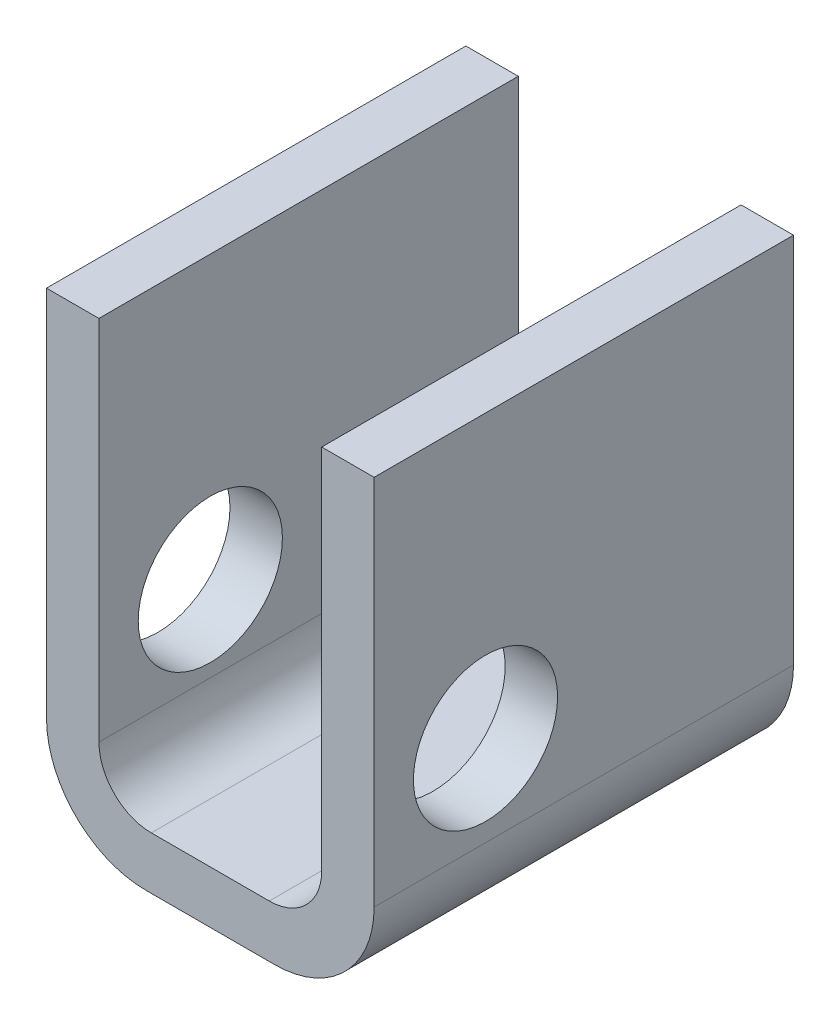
from build123d import *

# Parameters (mm, degrees)
EXTRUDE1_DEPTH = 50.8
SKETCH2_R      = 8.73125
EXTRUDE2_DEPTH = 167.92120159


with BuildPart() as part:
    # Sketch1 → Extrude1 (new body)
    with BuildSketch(Plane.XY):
        with BuildLine():
            Line((238.514744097, 109.520613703), (238.514744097, 153.970613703))
            Line((238.514744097, 153.970613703), (244.864744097, 153.970613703))
            Line((244.864744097, 153.970613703), (244.864744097, 108.888153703))
            ThreePointArc((244.864744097, 108.888153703), (241.330243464, 100.355114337), (232.797204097, 96.820613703))
            Line((232.797204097, 96.820613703), (217.244784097, 96.820613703))
            ThreePointArc((217.244784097, 96.820613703), (208.711744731, 100.355114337), (205.177244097, 108.888153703))
            Line((205.177244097, 108.888153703), (205.177244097, 153.970613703))
            Line((205.177244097, 153.970613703), (211.527244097, 153.970613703))
            Line((211.527244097, 153.970613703), (211.527244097, 109.520613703))
            ThreePointArc((211.527244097, 109.520613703), (213.387116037, 105.030485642), (217.877244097, 103.170613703))
            Line((217.877244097, 103.170613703), (232.164744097, 103.170613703))
            ThreePointArc((232.164744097, 103.170613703), (236.654872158, 105.030485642), (238.514744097, 109.520613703))
        make_face()
    extrude(amount=EXTRUDE1_DEPTH)

    # Sketch2 → Extrude2 (cut, through all)
    with BuildSketch(Plane(origin=(244.864744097, 0, 0), x_dir=(0, 0, -1), z_dir=(1, 0, 0))):
        with Locations((-37.30625, 119.839363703)):
            Circle(SKETCH2_R)
    extrude(amount=-EXTRUDE2_DEPTH, mode=Mode.SUBTRACT)


solid = part.part
